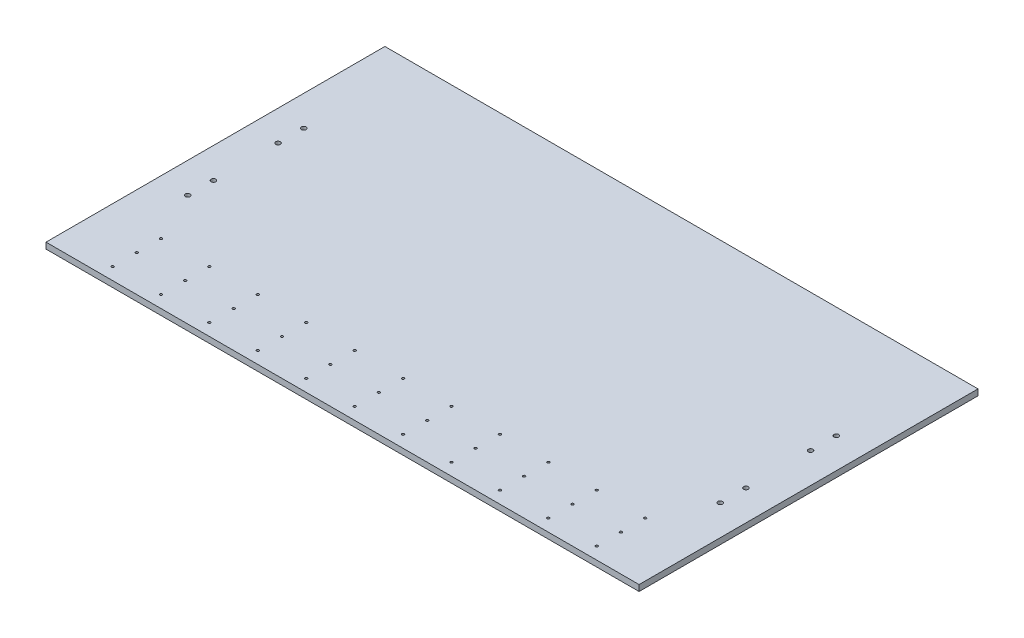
from build123d import *

# Parameters (mm, degrees)
SKETCH1_W               = 1244.6
SKETCH1_H               = 711.2
BOSS_EXTRUDE1_DEPTH     = 12.7
F_3_8_CLEARANCE_HOLE1_D = 9.8044
F_1_4_20_TAPPED_HOLE1_D = 5.1054
LPATTERN1_COUNT         = 11
LPATTERN1_PITCH         = 101.6
LPATTERN1_COUNT_DIR2    = 3
LPATTERN1_PITCH_DIR2    = 50.8


with BuildPart() as part:
    # Sketch1 → Boss-Extrude1 (new body)
    with BuildSketch(Plane(origin=(0, 0, 0), x_dir=(1, 0, 0), z_dir=(0, 1, 0))):
        Rectangle(SKETCH1_W, SKETCH1_H)
    extrude(amount=BOSS_EXTRUDE1_DEPTH)

    # 3_8 Clearance Hole1 (through all)
    with Locations(Plane(origin=(0, 12.7, 0), x_dir=(1, 0, 0), z_dir=(0, 1, 0))):
        with Locations((-558.8, 121.840625), (-558.8, 67.865625), (-558.8, -67.865625), (-558.8, -121.840625), (558.8, 67.865625), (558.8, 121.840625), (558.8, -67.865625), (558.8, -121.840625)):
            Hole(F_3_8_CLEARANCE_HOLE1_D / 2)

    # 1_4-20 Tapped Hole1 (through all)
    with Locations(Plane(origin=(0, 12.7, 0), x_dir=(1, 0, 0), z_dir=(0, 1, 0))):
        with Locations((-508, -330.2)):
            f_1_4_20_tapped_hole1 = Hole(F_1_4_20_TAPPED_HOLE1_D / 2)

    # LPattern1: 1_4-20 Tapped Hole1 11 × 3
    with Locations(*[(i * LPATTERN1_PITCH, 0, -j * LPATTERN1_PITCH_DIR2) for i in range(LPATTERN1_COUNT) for j in range(LPATTERN1_COUNT_DIR2) if (i, j) != (0, 0)]):
        add(f_1_4_20_tapped_hole1, mode=Mode.SUBTRACT)


solid = part.part
